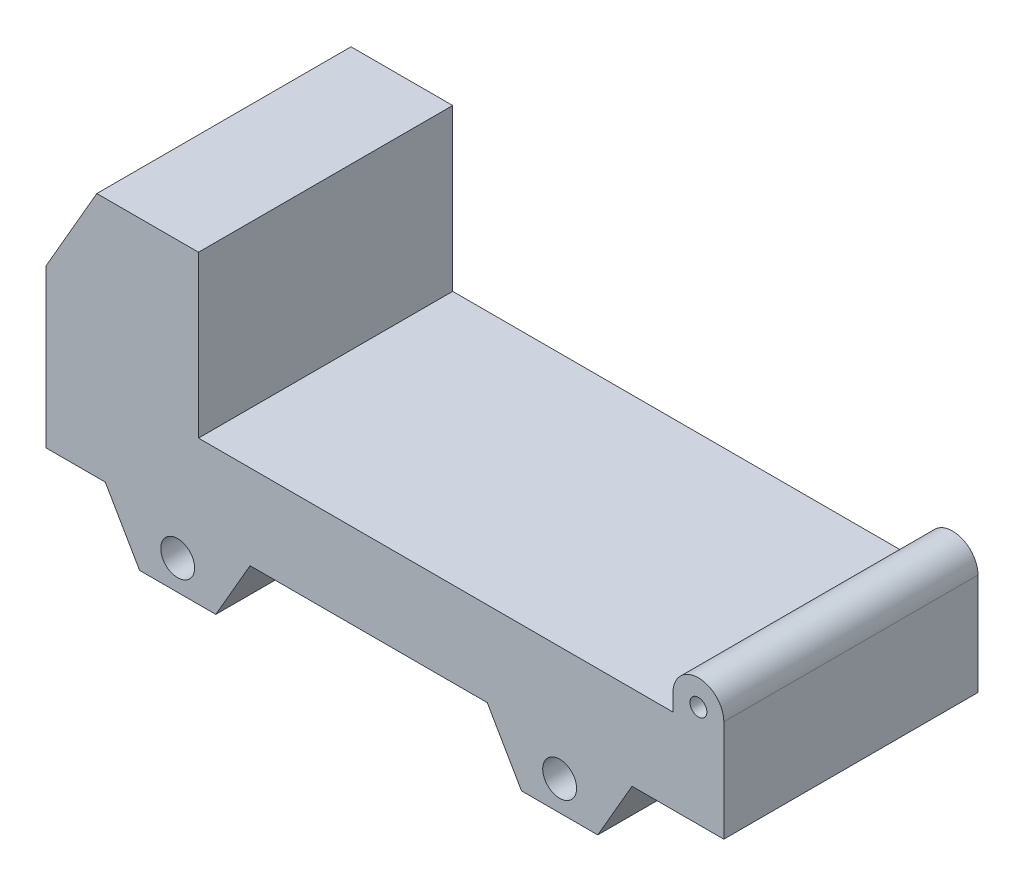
ISO-10303-21;
HEADER;
FILE_DESCRIPTION(('STEP AP214'),'2;1');
FILE_NAME('part.step','',(''),(''),'','','');
FILE_SCHEMA(('AUTOMOTIVE_DESIGN { 1 0 10303 214 1 1 1 1 }'));
ENDSEC;
DATA;
#1=APPLICATION_CONTEXT('core data for automotive mechanical design processes');
#2=APPLICATION_PROTOCOL_DEFINITION('international standard','automotive_design',2000,#1);
#3=PRODUCT_CONTEXT('',#1,'mechanical');
#4=PRODUCT('Part','Part','',(#3));
#5=PRODUCT_RELATED_PRODUCT_CATEGORY('part','',(#4));
#6=PRODUCT_DEFINITION_FORMATION('','',#4);
#7=PRODUCT_DEFINITION_CONTEXT('part definition',#1,'design');
#8=PRODUCT_DEFINITION('design','',#6,#7);
#9=PRODUCT_DEFINITION_SHAPE('','',#8);
#10=(LENGTH_UNIT() NAMED_UNIT(*) SI_UNIT(.MILLI.,.METRE.));
#11=(NAMED_UNIT(*) PLANE_ANGLE_UNIT() SI_UNIT($,.RADIAN.));
#12=(NAMED_UNIT(*) SI_UNIT($,.STERADIAN.) SOLID_ANGLE_UNIT());
#13=UNCERTAINTY_MEASURE_WITH_UNIT(LENGTH_MEASURE(1.E-05),#10,'distance_accuracy_value','');
#14=(GEOMETRIC_REPRESENTATION_CONTEXT(3) GLOBAL_UNCERTAINTY_ASSIGNED_CONTEXT((#13)) GLOBAL_UNIT_ASSIGNED_CONTEXT((#10,
#11,#12)) REPRESENTATION_CONTEXT('',''));
#15=CARTESIAN_POINT('',(0.,0.,0.));
#16=DIRECTION('',(0.,0.,1.));
#17=DIRECTION('',(1.,0.,0.));
#18=AXIS2_PLACEMENT_3D('',#15,#16,#17);
#19=CARTESIAN_POINT('',(295.,9.99999999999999,150.));
#20=DIRECTION('',(0.,0.,1.));
#21=DIRECTION('',(1.,0.,0.));
#22=AXIS2_PLACEMENT_3D('',#19,#20,#21);
#23=PLANE('',#22);
#24=CARTESIAN_POINT('',(295.,9.99999999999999,150.));
#25=DIRECTION('',(0.,0.,1.));
#26=DIRECTION('',(1.,0.,0.));
#27=AXIS2_PLACEMENT_3D('',#24,#25,#26);
#28=CIRCLE('',#27,4.99999999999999);
#29=CARTESIAN_POINT('',(300.,9.99999999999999,150.));
#30=VERTEX_POINT('',#29);
#31=EDGE_CURVE('E524',#30,#30,#28,.T.);
#32=ORIENTED_EDGE('',*,*,#31,.F.);
#33=EDGE_LOOP('',(#32));
#34=FACE_BOUND('',#33,.T.);
#35=DIRECTION('',(-0.500000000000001,-0.866025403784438,0.));
#36=VECTOR('',#35,1.);
#37=CARTESIAN_POINT('',(-60.,95.,150.));
#38=LINE('',#37,#36);
#39=CARTESIAN_POINT('',(-60.,95.,150.));
#40=VERTEX_POINT('',#39);
#41=CARTESIAN_POINT('',(-90.,43.0384757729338,150.));
#42=VERTEX_POINT('',#41);
#43=EDGE_CURVE('E389',#40,#42,#38,.T.);
#44=ORIENTED_EDGE('',*,*,#43,.T.);
#45=DIRECTION('',(0.,-1.,0.));
#46=VECTOR('',#45,1.);
#47=CARTESIAN_POINT('',(-90.,43.0384757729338,150.));
#48=LINE('',#47,#46);
#49=CARTESIAN_POINT('',(-90.,-50.,150.));
#50=VERTEX_POINT('',#49);
#51=EDGE_CURVE('E291',#42,#50,#48,.T.);
#52=ORIENTED_EDGE('',*,*,#51,.T.);
#53=DIRECTION('',(1.,0.,0.));
#54=VECTOR('',#53,1.);
#55=CARTESIAN_POINT('',(-90.,-50.,150.));
#56=LINE('',#55,#54);
#57=CARTESIAN_POINT('',(-55.,-50.,150.));
#58=VERTEX_POINT('',#57);
#59=EDGE_CURVE('E431',#50,#58,#56,.T.);
#60=ORIENTED_EDGE('',*,*,#59,.T.);
#61=DIRECTION('',(0.499999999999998,-0.86602540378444,0.));
#62=VECTOR('',#61,1.);
#63=CARTESIAN_POINT('',(-55.,-50.,150.));
#64=LINE('',#63,#62);
#65=CARTESIAN_POINT('',(-34.7927405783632,-85.,150.));
#66=VERTEX_POINT('',#65);
#67=EDGE_CURVE('E450',#58,#66,#64,.T.);
#68=ORIENTED_EDGE('',*,*,#67,.T.);
#69=DIRECTION('',(1.,0.,0.));
#70=VECTOR('',#69,1.);
#71=CARTESIAN_POINT('',(-34.7927405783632,-85.,150.));
#72=LINE('',#71,#70);
#73=CARTESIAN_POINT('',(10.2072594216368,-85.,150.));
#74=VERTEX_POINT('',#73);
#75=EDGE_CURVE('E447',#66,#74,#72,.T.);
#76=ORIENTED_EDGE('',*,*,#75,.T.);
#77=DIRECTION('',(0.499999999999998,0.86602540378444,0.));
#78=VECTOR('',#77,1.);
#79=CARTESIAN_POINT('',(10.2072594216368,-85.,150.));
#80=LINE('',#79,#78);
#81=CARTESIAN_POINT('',(30.4145188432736,-50.,150.));
#82=VERTEX_POINT('',#81);
#83=EDGE_CURVE('E449',#74,#82,#80,.T.);
#84=ORIENTED_EDGE('',*,*,#83,.T.);
#85=DIRECTION('',(1.,0.,0.));
#86=VECTOR('',#85,1.);
#87=CARTESIAN_POINT('',(30.4145188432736,-50.,150.));
#88=LINE('',#87,#86);
#89=CARTESIAN_POINT('',(170.414518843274,-50.,150.));
#90=VERTEX_POINT('',#89);
#91=EDGE_CURVE('E452',#82,#90,#88,.T.);
#92=ORIENTED_EDGE('',*,*,#91,.T.);
#93=DIRECTION('',(0.499999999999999,-0.866025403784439,0.));
#94=VECTOR('',#93,1.);
#95=CARTESIAN_POINT('',(170.414518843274,-50.,150.));
#96=LINE('',#95,#94);
#97=CARTESIAN_POINT('',(190.62177826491,-85.,150.));
#98=VERTEX_POINT('',#97);
#99=EDGE_CURVE('E458',#90,#98,#96,.T.);
#100=ORIENTED_EDGE('',*,*,#99,.T.);
#101=DIRECTION('',(1.,0.,0.));
#102=VECTOR('',#101,1.);
#103=CARTESIAN_POINT('',(190.62177826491,-85.,150.));
#104=LINE('',#103,#102);
#105=CARTESIAN_POINT('',(235.62177826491,-85.0000000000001,150.));
#106=VERTEX_POINT('',#105);
#107=EDGE_CURVE('E460',#98,#106,#104,.T.);
#108=ORIENTED_EDGE('',*,*,#107,.T.);
#109=DIRECTION('',(0.499999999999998,0.86602540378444,0.));
#110=VECTOR('',#109,1.);
#111=CARTESIAN_POINT('',(235.62177826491,-85.0000000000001,150.));
#112=LINE('',#111,#110);
#113=CARTESIAN_POINT('',(255.829037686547,-50.,150.));
#114=VERTEX_POINT('',#113);
#115=EDGE_CURVE('E462',#106,#114,#112,.T.);
#116=ORIENTED_EDGE('',*,*,#115,.T.);
#117=DIRECTION('',(1.,0.,0.));
#118=VECTOR('',#117,1.);
#119=CARTESIAN_POINT('',(255.829037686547,-50.,150.));
#120=LINE('',#119,#118);
#121=CARTESIAN_POINT('',(310.,-50.,150.));
#122=VERTEX_POINT('',#121);
#123=EDGE_CURVE('E464',#114,#122,#120,.T.);
#124=ORIENTED_EDGE('',*,*,#123,.T.);
#125=DIRECTION('',(0.,1.,0.));
#126=VECTOR('',#125,1.);
#127=CARTESIAN_POINT('',(310.,-50.,150.));
#128=LINE('',#127,#126);
#129=CARTESIAN_POINT('',(310.,9.99999999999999,150.));
#130=VERTEX_POINT('',#129);
#131=EDGE_CURVE('E466',#122,#130,#128,.T.);
#132=ORIENTED_EDGE('',*,*,#131,.T.);
#133=CARTESIAN_POINT('',(295.,9.99999999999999,150.));
#134=DIRECTION('',(0.,0.,1.));
#135=DIRECTION('',(1.,0.,0.));
#136=AXIS2_PLACEMENT_3D('',#133,#134,#135);
#137=CIRCLE('',#136,15.);
#138=CARTESIAN_POINT('',(280.,9.99999999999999,150.));
#139=VERTEX_POINT('',#138);
#140=EDGE_CURVE('E468',#130,#139,#137,.T.);
#141=ORIENTED_EDGE('',*,*,#140,.T.);
#142=DIRECTION('',(0.,-1.,0.));
#143=VECTOR('',#142,1.);
#144=CARTESIAN_POINT('',(280.,9.99999999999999,150.));
#145=LINE('',#144,#143);
#146=CARTESIAN_POINT('',(280.,0.,150.));
#147=VERTEX_POINT('',#146);
#148=EDGE_CURVE('E337',#139,#147,#145,.T.);
#149=ORIENTED_EDGE('',*,*,#148,.T.);
#150=DIRECTION('',(-1.,0.,0.));
#151=VECTOR('',#150,1.);
#152=CARTESIAN_POINT('',(280.,0.,150.));
#153=LINE('',#152,#151);
#154=CARTESIAN_POINT('',(0.,0.,150.));
#155=VERTEX_POINT('',#154);
#156=EDGE_CURVE('E331',#147,#155,#153,.T.);
#157=ORIENTED_EDGE('',*,*,#156,.T.);
#158=DIRECTION('',(0.,1.,0.));
#159=VECTOR('',#158,1.);
#160=CARTESIAN_POINT('',(0.,0.,150.));
#161=LINE('',#160,#159);
#162=CARTESIAN_POINT('',(0.,95.,150.));
#163=VERTEX_POINT('',#162);
#164=EDGE_CURVE('E335',#155,#163,#161,.T.);
#165=ORIENTED_EDGE('',*,*,#164,.T.);
#166=DIRECTION('',(-1.,0.,0.));
#167=VECTOR('',#166,1.);
#168=CARTESIAN_POINT('',(0.,95.,150.));
#169=LINE('',#168,#167);
#170=EDGE_CURVE('E221',#163,#40,#169,.T.);
#171=ORIENTED_EDGE('',*,*,#170,.T.);
#172=EDGE_LOOP('',(#44,#52,#60,#68,#76,#84,#92,#100,#108,#116,#124,#132,#141,#149,#157,#165,#171));
#173=FACE_BOUND('',#172,.T.);
#174=CARTESIAN_POINT('',(-12.2927405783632,-67.5,150.));
#175=DIRECTION('',(0.,0.,1.));
#176=DIRECTION('',(1.,0.,0.));
#177=AXIS2_PLACEMENT_3D('',#174,#175,#176);
#178=CIRCLE('',#177,10.);
#179=CARTESIAN_POINT('',(-2.29274057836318,-67.5,150.));
#180=VERTEX_POINT('',#179);
#181=EDGE_CURVE('E359',#180,#180,#178,.T.);
#182=ORIENTED_EDGE('',*,*,#181,.F.);
#183=EDGE_LOOP('',(#182));
#184=FACE_BOUND('',#183,.T.);
#185=CARTESIAN_POINT('',(213.12177826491,-67.5,150.));
#186=DIRECTION('',(0.,0.,1.));
#187=DIRECTION('',(1.,0.,0.));
#188=AXIS2_PLACEMENT_3D('',#185,#186,#187);
#189=CIRCLE('',#188,10.);
#190=CARTESIAN_POINT('',(223.12177826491,-67.5,150.));
#191=VERTEX_POINT('',#190);
#192=EDGE_CURVE('E515',#191,#191,#189,.T.);
#193=ORIENTED_EDGE('',*,*,#192,.F.);
#194=EDGE_LOOP('',(#193));
#195=FACE_BOUND('',#194,.T.);
#196=ADVANCED_FACE('F204',(#34,#173,#184,#195),#23,.T.);
#197=CARTESIAN_POINT('',(295.,9.99999999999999,0.));
#198=DIRECTION('',(0.,0.,1.));
#199=DIRECTION('',(1.,0.,0.));
#200=AXIS2_PLACEMENT_3D('',#197,#198,#199);
#201=PLANE('',#200);
#202=CARTESIAN_POINT('',(295.,9.99999999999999,0.));
#203=DIRECTION('',(0.,0.,1.));
#204=DIRECTION('',(1.,0.,0.));
#205=AXIS2_PLACEMENT_3D('',#202,#203,#204);
#206=CIRCLE('',#205,4.99999999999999);
#207=CARTESIAN_POINT('',(300.,9.99999999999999,0.));
#208=VERTEX_POINT('',#207);
#209=EDGE_CURVE('E521',#208,#208,#206,.T.);
#210=ORIENTED_EDGE('',*,*,#209,.T.);
#211=EDGE_LOOP('',(#210));
#212=FACE_BOUND('',#211,.T.);
#213=DIRECTION('',(-0.500000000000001,-0.866025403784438,0.));
#214=VECTOR('',#213,1.);
#215=CARTESIAN_POINT('',(-60.,95.,0.));
#216=LINE('',#215,#214);
#217=CARTESIAN_POINT('',(-60.,95.,0.));
#218=VERTEX_POINT('',#217);
#219=CARTESIAN_POINT('',(-90.,43.0384757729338,0.));
#220=VERTEX_POINT('',#219);
#221=EDGE_CURVE('E355',#218,#220,#216,.T.);
#222=ORIENTED_EDGE('',*,*,#221,.F.);
#223=DIRECTION('',(-1.,0.,0.));
#224=VECTOR('',#223,1.);
#225=CARTESIAN_POINT('',(0.,95.,0.));
#226=LINE('',#225,#224);
#227=CARTESIAN_POINT('',(0.,95.,0.));
#228=VERTEX_POINT('',#227);
#229=EDGE_CURVE('E283',#228,#218,#226,.T.);
#230=ORIENTED_EDGE('',*,*,#229,.F.);
#231=DIRECTION('',(0.,1.,0.));
#232=VECTOR('',#231,1.);
#233=CARTESIAN_POINT('',(0.,0.,0.));
#234=LINE('',#233,#232);
#235=CARTESIAN_POINT('',(0.,0.,0.));
#236=VERTEX_POINT('',#235);
#237=EDGE_CURVE('E277',#236,#228,#234,.T.);
#238=ORIENTED_EDGE('',*,*,#237,.F.);
#239=DIRECTION('',(-1.,0.,0.));
#240=VECTOR('',#239,1.);
#241=CARTESIAN_POINT('',(280.,0.,0.));
#242=LINE('',#241,#240);
#243=CARTESIAN_POINT('',(280.,0.,0.));
#244=VERTEX_POINT('',#243);
#245=EDGE_CURVE('E345',#244,#236,#242,.T.);
#246=ORIENTED_EDGE('',*,*,#245,.F.);
#247=DIRECTION('',(0.,-1.,0.));
#248=VECTOR('',#247,1.);
#249=CARTESIAN_POINT('',(280.,9.99999999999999,0.));
#250=LINE('',#249,#248);
#251=CARTESIAN_POINT('',(280.,9.99999999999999,0.));
#252=VERTEX_POINT('',#251);
#253=EDGE_CURVE('E384',#252,#244,#250,.T.);
#254=ORIENTED_EDGE('',*,*,#253,.F.);
#255=CARTESIAN_POINT('',(295.,9.99999999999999,0.));
#256=DIRECTION('',(0.,0.,1.));
#257=DIRECTION('',(1.,0.,0.));
#258=AXIS2_PLACEMENT_3D('',#255,#256,#257);
#259=CIRCLE('',#258,15.);
#260=CARTESIAN_POINT('',(310.,9.99999999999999,0.));
#261=VERTEX_POINT('',#260);
#262=EDGE_CURVE('E382',#261,#252,#259,.T.);
#263=ORIENTED_EDGE('',*,*,#262,.F.);
#264=DIRECTION('',(0.,1.,0.));
#265=VECTOR('',#264,1.);
#266=CARTESIAN_POINT('',(310.,0.,0.));
#267=LINE('',#266,#265);
#268=CARTESIAN_POINT('',(310.,-50.,0.));
#269=VERTEX_POINT('',#268);
#270=EDGE_CURVE('E380',#269,#261,#267,.T.);
#271=ORIENTED_EDGE('',*,*,#270,.F.);
#272=DIRECTION('',(1.,0.,0.));
#273=VECTOR('',#272,1.);
#274=CARTESIAN_POINT('',(255.829037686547,-50.,0.));
#275=LINE('',#274,#273);
#276=CARTESIAN_POINT('',(255.829037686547,-50.,0.));
#277=VERTEX_POINT('',#276);
#278=EDGE_CURVE('E377',#277,#269,#275,.T.);
#279=ORIENTED_EDGE('',*,*,#278,.F.);
#280=DIRECTION('',(0.499999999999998,0.86602540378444,0.));
#281=VECTOR('',#280,1.);
#282=CARTESIAN_POINT('',(235.62177826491,-85.0000000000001,0.));
#283=LINE('',#282,#281);
#284=CARTESIAN_POINT('',(235.62177826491,-85.0000000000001,0.));
#285=VERTEX_POINT('',#284);
#286=EDGE_CURVE('E375',#285,#277,#283,.T.);
#287=ORIENTED_EDGE('',*,*,#286,.F.);
#288=DIRECTION('',(1.,0.,0.));
#289=VECTOR('',#288,1.);
#290=CARTESIAN_POINT('',(190.62177826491,-85.,0.));
#291=LINE('',#290,#289);
#292=CARTESIAN_POINT('',(190.62177826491,-85.,0.));
#293=VERTEX_POINT('',#292);
#294=EDGE_CURVE('E373',#293,#285,#291,.T.);
#295=ORIENTED_EDGE('',*,*,#294,.F.);
#296=DIRECTION('',(0.499999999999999,-0.866025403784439,0.));
#297=VECTOR('',#296,1.);
#298=CARTESIAN_POINT('',(170.414518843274,-50.,0.));
#299=LINE('',#298,#297);
#300=CARTESIAN_POINT('',(170.414518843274,-50.,0.));
#301=VERTEX_POINT('',#300);
#302=EDGE_CURVE('E371',#301,#293,#299,.T.);
#303=ORIENTED_EDGE('',*,*,#302,.F.);
#304=DIRECTION('',(1.,0.,0.));
#305=VECTOR('',#304,1.);
#306=CARTESIAN_POINT('',(30.4145188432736,-50.,0.));
#307=LINE('',#306,#305);
#308=CARTESIAN_POINT('',(30.4145188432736,-50.,0.));
#309=VERTEX_POINT('',#308);
#310=EDGE_CURVE('E369',#309,#301,#307,.T.);
#311=ORIENTED_EDGE('',*,*,#310,.F.);
#312=DIRECTION('',(0.499999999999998,0.86602540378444,0.));
#313=VECTOR('',#312,1.);
#314=CARTESIAN_POINT('',(10.2072594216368,-85.,0.));
#315=LINE('',#314,#313);
#316=CARTESIAN_POINT('',(10.2072594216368,-85.,0.));
#317=VERTEX_POINT('',#316);
#318=EDGE_CURVE('E367',#317,#309,#315,.T.);
#319=ORIENTED_EDGE('',*,*,#318,.F.);
#320=DIRECTION('',(1.,0.,0.));
#321=VECTOR('',#320,1.);
#322=CARTESIAN_POINT('',(-34.7927405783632,-85.,0.));
#323=LINE('',#322,#321);
#324=CARTESIAN_POINT('',(-34.7927405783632,-85.,0.));
#325=VERTEX_POINT('',#324);
#326=EDGE_CURVE('E365',#325,#317,#323,.T.);
#327=ORIENTED_EDGE('',*,*,#326,.F.);
#328=DIRECTION('',(0.499999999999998,-0.86602540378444,0.));
#329=VECTOR('',#328,1.);
#330=CARTESIAN_POINT('',(-55.,-50.,0.));
#331=LINE('',#330,#329);
#332=CARTESIAN_POINT('',(-55.,-50.,0.));
#333=VERTEX_POINT('',#332);
#334=EDGE_CURVE('E363',#333,#325,#331,.T.);
#335=ORIENTED_EDGE('',*,*,#334,.F.);
#336=DIRECTION('',(1.,0.,0.));
#337=VECTOR('',#336,1.);
#338=CARTESIAN_POINT('',(-90.,-50.,0.));
#339=LINE('',#338,#337);
#340=CARTESIAN_POINT('',(-90.,-50.,0.));
#341=VERTEX_POINT('',#340);
#342=EDGE_CURVE('E361',#341,#333,#339,.T.);
#343=ORIENTED_EDGE('',*,*,#342,.F.);
#344=DIRECTION('',(0.,-1.,0.));
#345=VECTOR('',#344,1.);
#346=CARTESIAN_POINT('',(-90.,43.0384757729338,0.));
#347=LINE('',#346,#345);
#348=EDGE_CURVE('E358',#220,#341,#347,.T.);
#349=ORIENTED_EDGE('',*,*,#348,.F.);
#350=EDGE_LOOP('',(#222,#230,#238,#246,#254,#263,#271,#279,#287,#295,#303,#311,#319,#327,#335,
#343,#349));
#351=FACE_BOUND('',#350,.T.);
#352=CARTESIAN_POINT('',(-12.2927405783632,-67.5,0.));
#353=DIRECTION('',(0.,0.,1.));
#354=DIRECTION('',(1.,0.,0.));
#355=AXIS2_PLACEMENT_3D('',#352,#353,#354);
#356=CIRCLE('',#355,10.);
#357=CARTESIAN_POINT('',(-2.29274057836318,-67.5,0.));
#358=VERTEX_POINT('',#357);
#359=EDGE_CURVE('E527',#358,#358,#356,.T.);
#360=ORIENTED_EDGE('',*,*,#359,.T.);
#361=EDGE_LOOP('',(#360));
#362=FACE_BOUND('',#361,.T.);
#363=CARTESIAN_POINT('',(213.12177826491,-67.5,0.));
#364=DIRECTION('',(0.,0.,1.));
#365=DIRECTION('',(1.,0.,0.));
#366=AXIS2_PLACEMENT_3D('',#363,#364,#365);
#367=CIRCLE('',#366,10.);
#368=CARTESIAN_POINT('',(223.12177826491,-67.5,0.));
#369=VERTEX_POINT('',#368);
#370=EDGE_CURVE('E518',#369,#369,#367,.T.);
#371=ORIENTED_EDGE('',*,*,#370,.T.);
#372=EDGE_LOOP('',(#371));
#373=FACE_BOUND('',#372,.T.);
#374=ADVANCED_FACE('F435',(#212,#351,#362,#373),#201,.F.);
#375=CARTESIAN_POINT('',(-60.,95.,150.));
#376=DIRECTION('',(0.866025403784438,-0.500000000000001,0.));
#377=DIRECTION('',(0.500000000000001,0.866025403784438,0.));
#378=AXIS2_PLACEMENT_3D('',#375,#376,#377);
#379=PLANE('',#378);
#380=ORIENTED_EDGE('',*,*,#221,.T.);
#381=DIRECTION('',(0.,0.,-1.));
#382=VECTOR('',#381,1.);
#383=CARTESIAN_POINT('',(-90.,43.0384757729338,150.));
#384=LINE('',#383,#382);
#385=EDGE_CURVE('E12',#42,#220,#384,.T.);
#386=ORIENTED_EDGE('',*,*,#385,.F.);
#387=ORIENTED_EDGE('',*,*,#43,.F.);
#388=DIRECTION('',(0.,0.,-1.));
#389=VECTOR('',#388,1.);
#390=CARTESIAN_POINT('',(-60.,95.,150.));
#391=LINE('',#390,#389);
#392=EDGE_CURVE('E351',#40,#218,#391,.T.);
#393=ORIENTED_EDGE('',*,*,#392,.T.);
#394=EDGE_LOOP('',(#380,#386,#387,#393));
#395=FACE_BOUND('',#394,.T.);
#396=ADVANCED_FACE('F206',(#395),#379,.F.);
#397=CARTESIAN_POINT('',(-90.,43.0384757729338,150.));
#398=DIRECTION('',(1.,0.,0.));
#399=DIRECTION('',(0.,1.,0.));
#400=AXIS2_PLACEMENT_3D('',#397,#398,#399);
#401=PLANE('',#400);
#402=ORIENTED_EDGE('',*,*,#348,.T.);
#403=DIRECTION('',(0.,0.,-1.));
#404=VECTOR('',#403,1.);
#405=CARTESIAN_POINT('',(-90.,-50.,150.));
#406=LINE('',#405,#404);
#407=EDGE_CURVE('E213',#50,#341,#406,.T.);
#408=ORIENTED_EDGE('',*,*,#407,.F.);
#409=ORIENTED_EDGE('',*,*,#51,.F.);
#410=ORIENTED_EDGE('',*,*,#385,.T.);
#411=EDGE_LOOP('',(#402,#408,#409,#410));
#412=FACE_BOUND('',#411,.T.);
#413=ADVANCED_FACE('F679',(#412),#401,.F.);
#414=CARTESIAN_POINT('',(-90.,-50.,150.));
#415=DIRECTION('',(0.,1.,0.));
#416=DIRECTION('',(0.,0.,1.));
#417=AXIS2_PLACEMENT_3D('',#414,#415,#416);
#418=PLANE('',#417);
#419=ORIENTED_EDGE('',*,*,#342,.T.);
#420=DIRECTION('',(0.,0.,-1.));
#421=VECTOR('',#420,1.);
#422=CARTESIAN_POINT('',(-55.,-50.,150.));
#423=LINE('',#422,#421);
#424=EDGE_CURVE('E423',#58,#333,#423,.T.);
#425=ORIENTED_EDGE('',*,*,#424,.F.);
#426=ORIENTED_EDGE('',*,*,#59,.F.);
#427=ORIENTED_EDGE('',*,*,#407,.T.);
#428=EDGE_LOOP('',(#419,#425,#426,#427));
#429=FACE_BOUND('',#428,.T.);
#430=ADVANCED_FACE('F429',(#429),#418,.F.);
#431=CARTESIAN_POINT('',(-55.,-50.,150.));
#432=DIRECTION('',(0.86602540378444,0.499999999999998,0.));
#433=DIRECTION('',(-0.499999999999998,0.86602540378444,0.));
#434=AXIS2_PLACEMENT_3D('',#431,#432,#433);
#435=PLANE('',#434);
#436=ORIENTED_EDGE('',*,*,#334,.T.);
#437=DIRECTION('',(0.,0.,-1.));
#438=VECTOR('',#437,1.);
#439=CARTESIAN_POINT('',(-34.7927405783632,-85.,150.));
#440=LINE('',#439,#438);
#441=EDGE_CURVE('E420',#66,#325,#440,.T.);
#442=ORIENTED_EDGE('',*,*,#441,.F.);
#443=ORIENTED_EDGE('',*,*,#67,.F.);
#444=ORIENTED_EDGE('',*,*,#424,.T.);
#445=EDGE_LOOP('',(#436,#442,#443,#444));
#446=FACE_BOUND('',#445,.T.);
#447=ADVANCED_FACE('F441',(#446),#435,.F.);
#448=CARTESIAN_POINT('',(-34.7927405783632,-85.,150.));
#449=DIRECTION('',(0.,1.,0.));
#450=DIRECTION('',(0.,0.,1.));
#451=AXIS2_PLACEMENT_3D('',#448,#449,#450);
#452=PLANE('',#451);
#453=ORIENTED_EDGE('',*,*,#326,.T.);
#454=DIRECTION('',(0.,0.,-1.));
#455=VECTOR('',#454,1.);
#456=CARTESIAN_POINT('',(10.2072594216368,-85.,150.));
#457=LINE('',#456,#455);
#458=EDGE_CURVE('E417',#74,#317,#457,.T.);
#459=ORIENTED_EDGE('',*,*,#458,.F.);
#460=ORIENTED_EDGE('',*,*,#75,.F.);
#461=ORIENTED_EDGE('',*,*,#441,.T.);
#462=EDGE_LOOP('',(#453,#459,#460,#461));
#463=FACE_BOUND('',#462,.T.);
#464=ADVANCED_FACE('F445',(#463),#452,.F.);
#465=CARTESIAN_POINT('',(10.2072594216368,-85.,150.));
#466=DIRECTION('',(-0.86602540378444,0.499999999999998,0.));
#467=DIRECTION('',(-0.499999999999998,-0.86602540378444,0.));
#468=AXIS2_PLACEMENT_3D('',#465,#466,#467);
#469=PLANE('',#468);
#470=ORIENTED_EDGE('',*,*,#318,.T.);
#471=DIRECTION('',(0.,0.,-1.));
#472=VECTOR('',#471,1.);
#473=CARTESIAN_POINT('',(30.4145188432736,-50.,150.));
#474=LINE('',#473,#472);
#475=EDGE_CURVE('E414',#82,#309,#474,.T.);
#476=ORIENTED_EDGE('',*,*,#475,.F.);
#477=ORIENTED_EDGE('',*,*,#83,.F.);
#478=ORIENTED_EDGE('',*,*,#458,.T.);
#479=EDGE_LOOP('',(#470,#476,#477,#478));
#480=FACE_BOUND('',#479,.T.);
#481=ADVANCED_FACE('F644',(#480),#469,.F.);
#482=CARTESIAN_POINT('',(30.4145188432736,-50.,150.));
#483=DIRECTION('',(0.,1.,0.));
#484=DIRECTION('',(-1.,0.,0.));
#485=AXIS2_PLACEMENT_3D('',#482,#483,#484);
#486=PLANE('',#485);
#487=ORIENTED_EDGE('',*,*,#310,.T.);
#488=DIRECTION('',(0.,0.,-1.));
#489=VECTOR('',#488,1.);
#490=CARTESIAN_POINT('',(170.414518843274,-50.,150.));
#491=LINE('',#490,#489);
#492=EDGE_CURVE('E411',#90,#301,#491,.T.);
#493=ORIENTED_EDGE('',*,*,#492,.F.);
#494=ORIENTED_EDGE('',*,*,#91,.F.);
#495=ORIENTED_EDGE('',*,*,#475,.T.);
#496=EDGE_LOOP('',(#487,#493,#494,#495));
#497=FACE_BOUND('',#496,.T.);
#498=ADVANCED_FACE('F634',(#497),#486,.F.);
#499=CARTESIAN_POINT('',(170.414518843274,-50.,150.));
#500=DIRECTION('',(0.866025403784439,0.499999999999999,0.));
#501=DIRECTION('',(-0.499999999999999,0.866025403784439,0.));
#502=AXIS2_PLACEMENT_3D('',#499,#500,#501);
#503=PLANE('',#502);
#504=ORIENTED_EDGE('',*,*,#302,.T.);
#505=DIRECTION('',(0.,0.,-1.));
#506=VECTOR('',#505,1.);
#507=CARTESIAN_POINT('',(190.62177826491,-85.,150.));
#508=LINE('',#507,#506);
#509=EDGE_CURVE('E408',#98,#293,#508,.T.);
#510=ORIENTED_EDGE('',*,*,#509,.F.);
#511=ORIENTED_EDGE('',*,*,#99,.F.);
#512=ORIENTED_EDGE('',*,*,#492,.T.);
#513=EDGE_LOOP('',(#504,#510,#511,#512));
#514=FACE_BOUND('',#513,.T.);
#515=ADVANCED_FACE('F624',(#514),#503,.F.);
#516=CARTESIAN_POINT('',(190.62177826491,-85.,150.));
#517=DIRECTION('',(0.,1.,0.));
#518=DIRECTION('',(-1.,0.,0.));
#519=AXIS2_PLACEMENT_3D('',#516,#517,#518);
#520=PLANE('',#519);
#521=ORIENTED_EDGE('',*,*,#294,.T.);
#522=DIRECTION('',(0.,0.,-1.));
#523=VECTOR('',#522,1.);
#524=CARTESIAN_POINT('',(235.62177826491,-85.0000000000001,150.));
#525=LINE('',#524,#523);
#526=EDGE_CURVE('E405',#106,#285,#525,.T.);
#527=ORIENTED_EDGE('',*,*,#526,.F.);
#528=ORIENTED_EDGE('',*,*,#107,.F.);
#529=ORIENTED_EDGE('',*,*,#509,.T.);
#530=EDGE_LOOP('',(#521,#527,#528,#529));
#531=FACE_BOUND('',#530,.T.);
#532=ADVANCED_FACE('F614',(#531),#520,.F.);
#533=CARTESIAN_POINT('',(235.62177826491,-85.0000000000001,150.));
#534=DIRECTION('',(-0.86602540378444,0.499999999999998,0.));
#535=DIRECTION('',(-0.499999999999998,-0.86602540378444,0.));
#536=AXIS2_PLACEMENT_3D('',#533,#534,#535);
#537=PLANE('',#536);
#538=ORIENTED_EDGE('',*,*,#286,.T.);
#539=DIRECTION('',(0.,0.,-1.));
#540=VECTOR('',#539,1.);
#541=CARTESIAN_POINT('',(255.829037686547,-50.,150.));
#542=LINE('',#541,#540);
#543=EDGE_CURVE('E402',#114,#277,#542,.T.);
#544=ORIENTED_EDGE('',*,*,#543,.F.);
#545=ORIENTED_EDGE('',*,*,#115,.F.);
#546=ORIENTED_EDGE('',*,*,#526,.T.);
#547=EDGE_LOOP('',(#538,#544,#545,#546));
#548=FACE_BOUND('',#547,.T.);
#549=ADVANCED_FACE('F604',(#548),#537,.F.);
#550=CARTESIAN_POINT('',(255.829037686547,-50.,150.));
#551=DIRECTION('',(0.,1.,0.));
#552=DIRECTION('',(-1.,0.,0.));
#553=AXIS2_PLACEMENT_3D('',#550,#551,#552);
#554=PLANE('',#553);
#555=ORIENTED_EDGE('',*,*,#278,.T.);
#556=DIRECTION('',(0.,0.,-1.));
#557=VECTOR('',#556,1.);
#558=CARTESIAN_POINT('',(310.,-50.,150.));
#559=LINE('',#558,#557);
#560=EDGE_CURVE('E399',#122,#269,#559,.T.);
#561=ORIENTED_EDGE('',*,*,#560,.F.);
#562=ORIENTED_EDGE('',*,*,#123,.F.);
#563=ORIENTED_EDGE('',*,*,#543,.T.);
#564=EDGE_LOOP('',(#555,#561,#562,#563));
#565=FACE_BOUND('',#564,.T.);
#566=ADVANCED_FACE('F593',(#565),#554,.F.);
#567=CARTESIAN_POINT('',(310.,0.,150.));
#568=DIRECTION('',(-1.,0.,0.));
#569=DIRECTION('',(0.,0.,1.));
#570=AXIS2_PLACEMENT_3D('',#567,#568,#569);
#571=PLANE('',#570);
#572=ORIENTED_EDGE('',*,*,#270,.T.);
#573=DIRECTION('',(0.,0.,-1.));
#574=VECTOR('',#573,1.);
#575=CARTESIAN_POINT('',(310.,9.99999999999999,150.));
#576=LINE('',#575,#574);
#577=EDGE_CURVE('E396',#130,#261,#576,.T.);
#578=ORIENTED_EDGE('',*,*,#577,.F.);
#579=ORIENTED_EDGE('',*,*,#131,.F.);
#580=ORIENTED_EDGE('',*,*,#560,.T.);
#581=EDGE_LOOP('',(#572,#578,#579,#580));
#582=FACE_BOUND('',#581,.T.);
#583=ADVANCED_FACE('F584',(#582),#571,.F.);
#584=CARTESIAN_POINT('',(295.,9.99999999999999,150.));
#585=DIRECTION('',(0.,0.,-1.));
#586=DIRECTION('',(-1.,0.,0.));
#587=AXIS2_PLACEMENT_3D('',#584,#585,#586);
#588=CYLINDRICAL_SURFACE('',#587,15.);
#589=ORIENTED_EDGE('',*,*,#262,.T.);
#590=DIRECTION('',(0.,0.,-1.));
#591=VECTOR('',#590,1.);
#592=CARTESIAN_POINT('',(280.,9.99999999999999,150.));
#593=LINE('',#592,#591);
#594=EDGE_CURVE('E393',#139,#252,#593,.T.);
#595=ORIENTED_EDGE('',*,*,#594,.F.);
#596=ORIENTED_EDGE('',*,*,#140,.F.);
#597=ORIENTED_EDGE('',*,*,#577,.T.);
#598=EDGE_LOOP('',(#589,#595,#596,#597));
#599=FACE_BOUND('',#598,.T.);
#600=ADVANCED_FACE('F474',(#599),#588,.T.);
#601=CARTESIAN_POINT('',(280.,9.99999999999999,150.));
#602=DIRECTION('',(1.,0.,0.));
#603=DIRECTION('',(0.,0.,-1.));
#604=AXIS2_PLACEMENT_3D('',#601,#602,#603);
#605=PLANE('',#604);
#606=ORIENTED_EDGE('',*,*,#253,.T.);
#607=DIRECTION('',(0.,0.,-1.));
#608=VECTOR('',#607,1.);
#609=CARTESIAN_POINT('',(280.,0.,150.));
#610=LINE('',#609,#608);
#611=EDGE_CURVE('E346',#147,#244,#610,.T.);
#612=ORIENTED_EDGE('',*,*,#611,.F.);
#613=ORIENTED_EDGE('',*,*,#148,.F.);
#614=ORIENTED_EDGE('',*,*,#594,.T.);
#615=EDGE_LOOP('',(#606,#612,#613,#614));
#616=FACE_BOUND('',#615,.T.);
#617=ADVANCED_FACE('F478',(#616),#605,.F.);
#618=CARTESIAN_POINT('',(280.,0.,150.));
#619=DIRECTION('',(0.,-1.,0.));
#620=DIRECTION('',(0.,0.,-1.));
#621=AXIS2_PLACEMENT_3D('',#618,#619,#620);
#622=PLANE('',#621);
#623=ORIENTED_EDGE('',*,*,#245,.T.);
#624=DIRECTION('',(0.,0.,-1.));
#625=VECTOR('',#624,1.);
#626=CARTESIAN_POINT('',(0.,0.,150.));
#627=LINE('',#626,#625);
#628=EDGE_CURVE('E342',#155,#236,#627,.T.);
#629=ORIENTED_EDGE('',*,*,#628,.F.);
#630=ORIENTED_EDGE('',*,*,#156,.F.);
#631=ORIENTED_EDGE('',*,*,#611,.T.);
#632=EDGE_LOOP('',(#623,#629,#630,#631));
#633=FACE_BOUND('',#632,.T.);
#634=ADVANCED_FACE('F343',(#633),#622,.F.);
#635=CARTESIAN_POINT('',(0.,0.,150.));
#636=DIRECTION('',(-1.,0.,0.));
#637=DIRECTION('',(0.,0.,1.));
#638=AXIS2_PLACEMENT_3D('',#635,#636,#637);
#639=PLANE('',#638);
#640=ORIENTED_EDGE('',*,*,#237,.T.);
#641=DIRECTION('',(0.,0.,-1.));
#642=VECTOR('',#641,1.);
#643=CARTESIAN_POINT('',(0.,95.,150.));
#644=LINE('',#643,#642);
#645=EDGE_CURVE('E347',#163,#228,#644,.T.);
#646=ORIENTED_EDGE('',*,*,#645,.F.);
#647=ORIENTED_EDGE('',*,*,#164,.F.);
#648=ORIENTED_EDGE('',*,*,#628,.T.);
#649=EDGE_LOOP('',(#640,#646,#647,#648));
#650=FACE_BOUND('',#649,.T.);
#651=ADVANCED_FACE('F349',(#650),#639,.F.);
#652=CARTESIAN_POINT('',(0.,95.,150.));
#653=DIRECTION('',(0.,-1.,0.));
#654=DIRECTION('',(0.,0.,-1.));
#655=AXIS2_PLACEMENT_3D('',#652,#653,#654);
#656=PLANE('',#655);
#657=ORIENTED_EDGE('',*,*,#229,.T.);
#658=ORIENTED_EDGE('',*,*,#392,.F.);
#659=ORIENTED_EDGE('',*,*,#170,.F.);
#660=ORIENTED_EDGE('',*,*,#645,.T.);
#661=EDGE_LOOP('',(#657,#658,#659,#660));
#662=FACE_BOUND('',#661,.T.);
#663=ADVANCED_FACE('F482',(#662),#656,.F.);
#664=CARTESIAN_POINT('',(-12.2927405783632,-67.5,150.));
#665=DIRECTION('',(0.,0.,-1.));
#666=DIRECTION('',(-1.,0.,0.));
#667=AXIS2_PLACEMENT_3D('',#664,#665,#666);
#668=CYLINDRICAL_SURFACE('',#667,10.);
#669=ORIENTED_EDGE('',*,*,#181,.T.);
#670=EDGE_LOOP('',(#669));
#671=FACE_BOUND('',#670,.T.);
#672=ORIENTED_EDGE('',*,*,#359,.F.);
#673=EDGE_LOOP('',(#672));
#674=FACE_BOUND('',#673,.T.);
#675=ADVANCED_FACE('F484',(#671,#674),#668,.F.);
#676=CARTESIAN_POINT('',(295.,9.99999999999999,150.));
#677=DIRECTION('',(0.,0.,-1.));
#678=DIRECTION('',(-1.,0.,0.));
#679=AXIS2_PLACEMENT_3D('',#676,#677,#678);
#680=CYLINDRICAL_SURFACE('',#679,4.99999999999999);
#681=ORIENTED_EDGE('',*,*,#31,.T.);
#682=EDGE_LOOP('',(#681));
#683=FACE_BOUND('',#682,.T.);
#684=ORIENTED_EDGE('',*,*,#209,.F.);
#685=EDGE_LOOP('',(#684));
#686=FACE_BOUND('',#685,.T.);
#687=ADVANCED_FACE('F490',(#683,#686),#680,.F.);
#688=CARTESIAN_POINT('',(213.12177826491,-67.5,150.));
#689=DIRECTION('',(0.,0.,-1.));
#690=DIRECTION('',(-1.,0.,0.));
#691=AXIS2_PLACEMENT_3D('',#688,#689,#690);
#692=CYLINDRICAL_SURFACE('',#691,10.);
#693=ORIENTED_EDGE('',*,*,#192,.T.);
#694=EDGE_LOOP('',(#693));
#695=FACE_BOUND('',#694,.T.);
#696=ORIENTED_EDGE('',*,*,#370,.F.);
#697=EDGE_LOOP('',(#696));
#698=FACE_BOUND('',#697,.T.);
#699=ADVANCED_FACE('F506',(#695,#698),#692,.F.);
#700=CLOSED_SHELL('',(#196,#374,#396,#413,#430,#447,#464,#481,#498,#515,#532,#549,#566,#583,
#600,#617,#634,#651,#663,#675,#687,#699));
#701=MANIFOLD_SOLID_BREP('B2',#700);
#702=ADVANCED_BREP_SHAPE_REPRESENTATION('',(#18,#701),#14);
#703=SHAPE_DEFINITION_REPRESENTATION(#9,#702);
ENDSEC;
END-ISO-10303-21;
